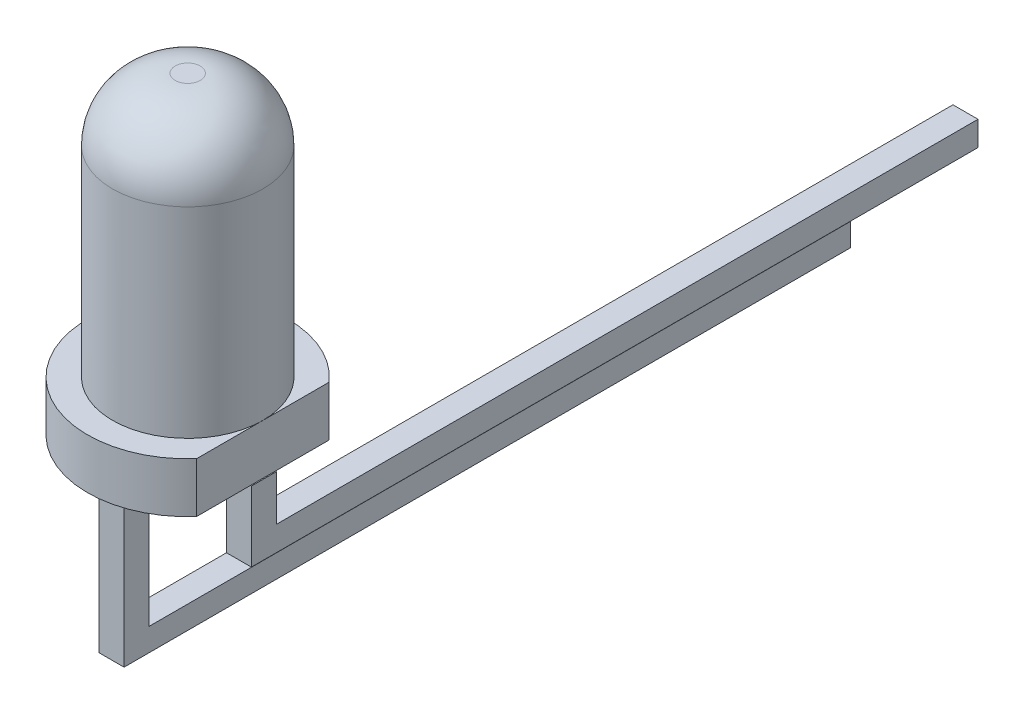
from build123d import *

# Parameters (mm, degrees)
CROQUIS1_R           = 2
BASE_DEPTH           = 1
CROQUIS2_R           = 1.5
CUERPO_DEL_LED_DEPTH = 5.25
CROQUIS3_W           = 0.5
CROQUIS3_H           = 0.5
PINES_DEPTH          = 1.4
RANURA_START         = -1
CROQUIS6_W           = 1
CROQUIS6_H           = 4.5
RANURA_DEPTH         = 6.25
PUNTA_DEL_LED_R      = 1.25
SKETCH1_W            = 0.5
SKETCH1_H            = 0.489635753
BOSS_EXTRUDE1_DEPTH  = 14
SKETCH4_W            = 0.5
SKETCH4_H            = 0.5
BOSS_EXTRUDE2_DEPTH  = 3
SKETCH5_W            = 0.5
SKETCH5_H            = 0.456100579
BOSS_EXTRUDE3_DEPTH  = 14


with BuildPart() as part:
    # Croquis1 → Base (new body)
    with BuildSketch(Plane(origin=(0, 0, 0), x_dir=(1, 0, 0), z_dir=(0, 1, 0))):
        Circle(CROQUIS1_R)
    extrude(amount=BASE_DEPTH)

    # Croquis2 → Cuerpo del LED (add)
    with BuildSketch(Plane(origin=(0, 1, 0), x_dir=(1, 0, 0), z_dir=(0, 1, 0))):
        Circle(CROQUIS2_R)
    extrude(amount=CUERPO_DEL_LED_DEPTH)

    # Croquis3 → Pines (add)
    with BuildSketch(Plane.XZ):
        with Locations((-1.270142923, 0)):
            Rectangle(CROQUIS3_W, CROQUIS3_H)
        with Locations((1.270172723, 0)):
            Rectangle(CROQUIS3_W, CROQUIS3_H)
    extrude(amount=PINES_DEPTH)

    # Croquis6 → Ranura (cut)
    with BuildSketch(Plane(origin=(0, 1, 0), x_dir=(1, 0, 0), z_dir=(0, 1, 0)).offset(RANURA_START)):
        with Locations((2, 0.48044739)):
            Rectangle(CROQUIS6_W, CROQUIS6_H)
    extrude(amount=RANURA_DEPTH, mode=Mode.SUBTRACT)

    # Punta del Led
    punta_del_led_edges = [part.edges().sort_by_distance(p)[0] for p in [
        (-1.5, 6.25, 0),
    ]]
    fillet(punta_del_led_edges, radius=PUNTA_DEL_LED_R)

    # Sketch1 → Boss-Extrude1 (add)
    with BuildSketch(Plane(origin=(0, 0, -0.25), x_dir=(-1, 0, 0), z_dir=(0, 0, -1))):
        with Locations((-1.270172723, -1.155182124)):
            Rectangle(SKETCH1_W, SKETCH1_H)
    extrude(amount=BOSS_EXTRUDE1_DEPTH)

    # Sketch4 → Boss-Extrude2 (add)
    with BuildSketch(Plane.XZ.offset(1.4)):
        with Locations((-1.270142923, 0)):
            Rectangle(SKETCH4_W, SKETCH4_H)
    extrude(amount=BOSS_EXTRUDE2_DEPTH)

    # Sketch5 → Boss-Extrude3 (add)
    with BuildSketch(Plane(origin=(0, 0, -0.25), x_dir=(-1, 0, 0), z_dir=(0, 0, -1))):
        with Locations((1.270142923, -4.17194971)):
            Rectangle(SKETCH5_W, SKETCH5_H)
    extrude(amount=BOSS_EXTRUDE3_DEPTH)


solid = part.part
